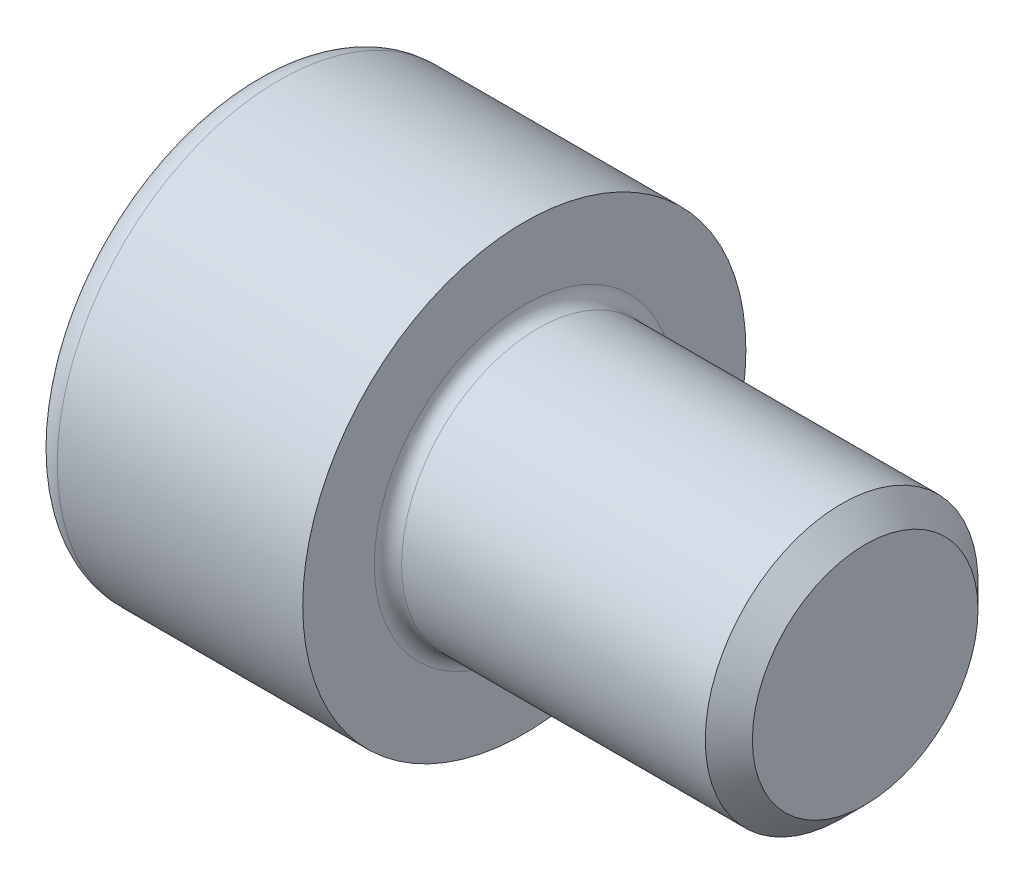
ISO-10303-21;
HEADER;
FILE_DESCRIPTION(('STEP AP214'),'2;1');
FILE_NAME('part.step','',(''),(''),'','','');
FILE_SCHEMA(('AUTOMOTIVE_DESIGN { 1 0 10303 214 1 1 1 1 }'));
ENDSEC;
DATA;
#1=APPLICATION_CONTEXT('core data for automotive mechanical design processes');
#2=APPLICATION_PROTOCOL_DEFINITION('international standard','automotive_design',2000,#1);
#3=PRODUCT_CONTEXT('',#1,'mechanical');
#4=PRODUCT('Part','Part','',(#3));
#5=PRODUCT_RELATED_PRODUCT_CATEGORY('part','',(#4));
#6=PRODUCT_DEFINITION_FORMATION('','',#4);
#7=PRODUCT_DEFINITION_CONTEXT('part definition',#1,'design');
#8=PRODUCT_DEFINITION('design','',#6,#7);
#9=PRODUCT_DEFINITION_SHAPE('','',#8);
#10=(LENGTH_UNIT() NAMED_UNIT(*) SI_UNIT(.MILLI.,.METRE.));
#11=(NAMED_UNIT(*) PLANE_ANGLE_UNIT() SI_UNIT($,.RADIAN.));
#12=(NAMED_UNIT(*) SI_UNIT($,.STERADIAN.) SOLID_ANGLE_UNIT());
#13=UNCERTAINTY_MEASURE_WITH_UNIT(LENGTH_MEASURE(1.E-05),#10,'distance_accuracy_value','');
#14=(GEOMETRIC_REPRESENTATION_CONTEXT(3) GLOBAL_UNCERTAINTY_ASSIGNED_CONTEXT((#13)) GLOBAL_UNIT_ASSIGNED_CONTEXT((#10,
#11,#12)) REPRESENTATION_CONTEXT('',''));
#15=CARTESIAN_POINT('',(0.,0.,0.));
#16=DIRECTION('',(0.,0.,1.));
#17=DIRECTION('',(1.,0.,0.));
#18=AXIS2_PLACEMENT_3D('',#15,#16,#17);
#19=CARTESIAN_POINT('',(0.,0.,0.));
#20=DIRECTION('',(-1.,0.,0.));
#21=DIRECTION('',(0.,0.,1.));
#22=AXIS2_PLACEMENT_3D('',#19,#20,#21);
#23=PLANE('',#22);
#24=DIRECTION('',(0.,-0.499999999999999,0.866025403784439));
#25=VECTOR('',#24,1.);
#26=CARTESIAN_POINT('',(0.,3.47564862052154,0.));
#27=LINE('',#26,#25);
#28=CARTESIAN_POINT('',(0.,3.47564862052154,0.));
#29=VERTEX_POINT('',#28);
#30=CARTESIAN_POINT('',(0.,1.73782431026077,3.00999999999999));
#31=VERTEX_POINT('',#30);
#32=EDGE_CURVE('E286',#29,#31,#27,.T.);
#33=ORIENTED_EDGE('',*,*,#32,.T.);
#34=DIRECTION('',(0.,1.,0.));
#35=VECTOR('',#34,1.);
#36=CARTESIAN_POINT('',(0.,-1.73782431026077,3.01));
#37=LINE('',#36,#35);
#38=CARTESIAN_POINT('',(0.,-1.73782431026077,3.01));
#39=VERTEX_POINT('',#38);
#40=EDGE_CURVE('E143',#39,#31,#37,.T.);
#41=ORIENTED_EDGE('',*,*,#40,.F.);
#42=DIRECTION('',(0.,-0.500000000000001,-0.866025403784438));
#43=VECTOR('',#42,1.);
#44=CARTESIAN_POINT('',(0.,-1.73782431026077,3.01));
#45=LINE('',#44,#43);
#46=CARTESIAN_POINT('',(0.,-3.47564862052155,0.));
#47=VERTEX_POINT('',#46);
#48=EDGE_CURVE('E291',#39,#47,#45,.T.);
#49=ORIENTED_EDGE('',*,*,#48,.T.);
#50=DIRECTION('',(0.,0.499999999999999,-0.866025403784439));
#51=VECTOR('',#50,1.);
#52=CARTESIAN_POINT('',(0.,-3.47564862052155,0.));
#53=LINE('',#52,#51);
#54=CARTESIAN_POINT('',(0.,-1.73782431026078,-3.01));
#55=VERTEX_POINT('',#54);
#56=EDGE_CURVE('E295',#47,#55,#53,.T.);
#57=ORIENTED_EDGE('',*,*,#56,.T.);
#58=DIRECTION('',(0.,-1.,0.));
#59=VECTOR('',#58,1.);
#60=CARTESIAN_POINT('',(0.,1.73782431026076,-3.01));
#61=LINE('',#60,#59);
#62=CARTESIAN_POINT('',(0.,1.73782431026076,-3.01));
#63=VERTEX_POINT('',#62);
#64=EDGE_CURVE('E299',#63,#55,#61,.T.);
#65=ORIENTED_EDGE('',*,*,#64,.F.);
#66=DIRECTION('',(0.,-0.500000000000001,-0.866025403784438));
#67=VECTOR('',#66,1.);
#68=CARTESIAN_POINT('',(0.,3.47564862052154,0.));
#69=LINE('',#68,#67);
#70=EDGE_CURVE('E138',#29,#63,#69,.T.);
#71=ORIENTED_EDGE('',*,*,#70,.F.);
#72=EDGE_LOOP('',(#33,#41,#49,#57,#65,#71));
#73=FACE_BOUND('',#72,.T.);
#74=CARTESIAN_POINT('',(0.,0.,0.));
#75=DIRECTION('',(-1.,0.,0.));
#76=DIRECTION('',(0.,0.,1.));
#77=AXIS2_PLACEMENT_3D('',#74,#75,#76);
#78=CIRCLE('',#77,5.7);
#79=CARTESIAN_POINT('',(0.,0.,5.7));
#80=VERTEX_POINT('',#79);
#81=EDGE_CURVE('E53',#80,#80,#78,.T.);
#82=ORIENTED_EDGE('',*,*,#81,.T.);
#83=EDGE_LOOP('',(#82));
#84=FACE_BOUND('',#83,.T.);
#85=ADVANCED_FACE('F44',(#73,#84),#23,.T.);
#86=CARTESIAN_POINT('',(-31.75,0.,0.));
#87=DIRECTION('',(-1.,0.,0.));
#88=DIRECTION('',(0.,0.,1.));
#89=AXIS2_PLACEMENT_3D('',#86,#87,#88);
#90=CYLINDRICAL_SURFACE('',#89,6.5);
#91=CARTESIAN_POINT('',(0.800000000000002,0.,0.));
#92=DIRECTION('',(-1.,0.,0.));
#93=DIRECTION('',(0.,0.,1.));
#94=AXIS2_PLACEMENT_3D('',#91,#92,#93);
#95=CIRCLE('',#94,6.5);
#96=CARTESIAN_POINT('',(0.800000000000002,0.,6.5));
#97=VERTEX_POINT('',#96);
#98=EDGE_CURVE('E11',#97,#97,#95,.F.);
#99=ORIENTED_EDGE('',*,*,#98,.T.);
#100=EDGE_LOOP('',(#99));
#101=FACE_BOUND('',#100,.T.);
#102=CARTESIAN_POINT('',(8.,0.,0.));
#103=DIRECTION('',(-1.,0.,0.));
#104=DIRECTION('',(0.,0.,1.));
#105=AXIS2_PLACEMENT_3D('',#102,#103,#104);
#106=CIRCLE('',#105,6.5);
#107=CARTESIAN_POINT('',(8.,0.,6.5));
#108=VERTEX_POINT('',#107);
#109=EDGE_CURVE('E167',#108,#108,#106,.T.);
#110=ORIENTED_EDGE('',*,*,#109,.T.);
#111=EDGE_LOOP('',(#110));
#112=FACE_BOUND('',#111,.T.);
#113=ADVANCED_FACE('F195',(#101,#112),#90,.T.);
#114=CARTESIAN_POINT('',(8.,6.5,0.));
#115=DIRECTION('',(1.,0.,0.));
#116=DIRECTION('',(0.,0.,-1.));
#117=AXIS2_PLACEMENT_3D('',#114,#115,#116);
#118=PLANE('',#117);
#119=CARTESIAN_POINT('',(8.,0.,0.));
#120=DIRECTION('',(1.,0.,0.));
#121=DIRECTION('',(0.,0.,-1.));
#122=AXIS2_PLACEMENT_3D('',#119,#120,#121);
#123=CIRCLE('',#122,4.39999999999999);
#124=CARTESIAN_POINT('',(8.,0.,-4.39999999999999));
#125=VERTEX_POINT('',#124);
#126=EDGE_CURVE('E171',#125,#125,#123,.F.);
#127=ORIENTED_EDGE('',*,*,#126,.T.);
#128=EDGE_LOOP('',(#127));
#129=FACE_BOUND('',#128,.T.);
#130=ORIENTED_EDGE('',*,*,#109,.F.);
#131=EDGE_LOOP('',(#130));
#132=FACE_BOUND('',#131,.T.);
#133=ADVANCED_FACE('F201',(#129,#132),#118,.T.);
#134=CARTESIAN_POINT('',(-31.75,0.,0.));
#135=DIRECTION('',(-1.,0.,0.));
#136=DIRECTION('',(0.,0.,1.));
#137=AXIS2_PLACEMENT_3D('',#134,#135,#136);
#138=CYLINDRICAL_SURFACE('',#137,3.99999999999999);
#139=CARTESIAN_POINT('',(8.4,0.,0.));
#140=DIRECTION('',(1.,0.,0.));
#141=DIRECTION('',(0.,0.,-1.));
#142=AXIS2_PLACEMENT_3D('',#139,#140,#141);
#143=CIRCLE('',#142,3.99999999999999);
#144=CARTESIAN_POINT('',(8.4,0.,-3.99999999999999));
#145=VERTEX_POINT('',#144);
#146=EDGE_CURVE('E175',#145,#145,#143,.T.);
#147=ORIENTED_EDGE('',*,*,#146,.T.);
#148=EDGE_LOOP('',(#147));
#149=FACE_BOUND('',#148,.T.);
#150=CARTESIAN_POINT('',(17.3095,0.,0.));
#151=DIRECTION('',(-1.,0.,0.));
#152=DIRECTION('',(0.,0.,1.));
#153=AXIS2_PLACEMENT_3D('',#150,#151,#152);
#154=CIRCLE('',#153,3.99999999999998);
#155=CARTESIAN_POINT('',(17.3095,0.,3.99999999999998));
#156=VERTEX_POINT('',#155);
#157=EDGE_CURVE('E163',#156,#156,#154,.T.);
#158=ORIENTED_EDGE('',*,*,#157,.T.);
#159=EDGE_LOOP('',(#158));
#160=FACE_BOUND('',#159,.T.);
#161=ADVANCED_FACE('F207',(#149,#160),#138,.T.);
#162=CARTESIAN_POINT('',(18.,0.,0.));
#163=DIRECTION('',(-1.,0.,0.));
#164=DIRECTION('',(0.,0.,1.));
#165=AXIS2_PLACEMENT_3D('',#162,#163,#164);
#166=CONICAL_SURFACE('',#165,3.3095,0.78539816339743);
#167=ORIENTED_EDGE('',*,*,#157,.F.);
#168=EDGE_LOOP('',(#167));
#169=FACE_BOUND('',#168,.T.);
#170=CARTESIAN_POINT('',(18.,0.,0.));
#171=DIRECTION('',(-1.,0.,0.));
#172=DIRECTION('',(0.,0.,1.));
#173=AXIS2_PLACEMENT_3D('',#170,#171,#172);
#174=CIRCLE('',#173,3.3095);
#175=CARTESIAN_POINT('',(18.,0.,3.3095));
#176=VERTEX_POINT('',#175);
#177=EDGE_CURVE('E158',#176,#176,#174,.T.);
#178=ORIENTED_EDGE('',*,*,#177,.T.);
#179=EDGE_LOOP('',(#178));
#180=FACE_BOUND('',#179,.T.);
#181=ADVANCED_FACE('F211',(#169,#180),#166,.T.);
#182=CARTESIAN_POINT('',(18.,3.3095,0.));
#183=DIRECTION('',(1.,0.,0.));
#184=DIRECTION('',(0.,0.,-1.));
#185=AXIS2_PLACEMENT_3D('',#182,#183,#184);
#186=PLANE('',#185);
#187=ORIENTED_EDGE('',*,*,#177,.F.);
#188=EDGE_LOOP('',(#187));
#189=FACE_BOUND('',#188,.T.);
#190=ADVANCED_FACE('F191',(#189),#186,.T.);
#191=CARTESIAN_POINT('',(8.4,0.,0.));
#192=DIRECTION('',(1.,0.,0.));
#193=DIRECTION('',(0.,0.,-1.));
#194=AXIS2_PLACEMENT_3D('',#191,#192,#193);
#195=TOROIDAL_SURFACE('',#194,4.39999999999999,0.4);
#196=ORIENTED_EDGE('',*,*,#146,.F.);
#197=EDGE_LOOP('',(#196));
#198=FACE_BOUND('',#197,.T.);
#199=ORIENTED_EDGE('',*,*,#126,.F.);
#200=EDGE_LOOP('',(#199));
#201=FACE_BOUND('',#200,.T.);
#202=ADVANCED_FACE('F184',(#198,#201),#195,.F.);
#203=CARTESIAN_POINT('',(0.800000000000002,0.,0.));
#204=DIRECTION('',(-1.,0.,0.));
#205=DIRECTION('',(0.,0.,1.));
#206=AXIS2_PLACEMENT_3D('',#203,#204,#205);
#207=TOROIDAL_SURFACE('',#206,5.7,0.8);
#208=ORIENTED_EDGE('',*,*,#98,.F.);
#209=EDGE_LOOP('',(#208));
#210=FACE_BOUND('',#209,.T.);
#211=ORIENTED_EDGE('',*,*,#81,.F.);
#212=EDGE_LOOP('',(#211));
#213=FACE_BOUND('',#212,.T.);
#214=ADVANCED_FACE('F46',(#210,#213),#207,.T.);
#215=CARTESIAN_POINT('',(4.,3.47564862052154,0.));
#216=DIRECTION('',(0.,-0.866025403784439,-0.499999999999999));
#217=DIRECTION('',(0.,0.499999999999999,-0.866025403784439));
#218=AXIS2_PLACEMENT_3D('',#215,#216,#217);
#219=PLANE('',#218);
#220=ORIENTED_EDGE('',*,*,#32,.F.);
#221=DIRECTION('',(-1.,0.,0.));
#222=VECTOR('',#221,1.);
#223=CARTESIAN_POINT('',(4.,3.47564862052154,0.));
#224=LINE('',#223,#222);
#225=CARTESIAN_POINT('',(4.,3.47564862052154,0.));
#226=VERTEX_POINT('',#225);
#227=EDGE_CURVE('E273',#226,#29,#224,.T.);
#228=ORIENTED_EDGE('',*,*,#227,.F.);
#229=DIRECTION('',(0.,-0.499999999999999,0.866025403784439));
#230=VECTOR('',#229,1.);
#231=CARTESIAN_POINT('',(4.,3.47564862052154,0.));
#232=LINE('',#231,#230);
#233=CARTESIAN_POINT('',(4.,2.60673646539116,1.50499999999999));
#234=VERTEX_POINT('',#233);
#235=EDGE_CURVE('E129',#226,#234,#232,.T.);
#236=ORIENTED_EDGE('',*,*,#235,.T.);
#237=CARTESIAN_POINT('',(4.,1.73782431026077,3.00999999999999));
#238=VERTEX_POINT('',#237);
#239=EDGE_CURVE('E119',#234,#238,#232,.T.);
#240=ORIENTED_EDGE('',*,*,#239,.T.);
#241=DIRECTION('',(-1.,0.,0.));
#242=VECTOR('',#241,1.);
#243=CARTESIAN_POINT('',(4.,1.73782431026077,3.00999999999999));
#244=LINE('',#243,#242);
#245=EDGE_CURVE('E134',#238,#31,#244,.T.);
#246=ORIENTED_EDGE('',*,*,#245,.T.);
#247=EDGE_LOOP('',(#220,#228,#236,#240,#246));
#248=FACE_BOUND('',#247,.T.);
#249=ADVANCED_FACE('F133',(#248),#219,.T.);
#250=CARTESIAN_POINT('',(4.,-1.73782431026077,3.01));
#251=DIRECTION('',(0.,0.,1.));
#252=DIRECTION('',(0.,-1.,0.));
#253=AXIS2_PLACEMENT_3D('',#250,#251,#252);
#254=PLANE('',#253);
#255=ORIENTED_EDGE('',*,*,#40,.T.);
#256=ORIENTED_EDGE('',*,*,#245,.F.);
#257=DIRECTION('',(0.,1.,0.));
#258=VECTOR('',#257,1.);
#259=CARTESIAN_POINT('',(4.,-1.73782431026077,3.01));
#260=LINE('',#259,#258);
#261=CARTESIAN_POINT('',(4.,0.,3.01));
#262=VERTEX_POINT('',#261);
#263=EDGE_CURVE('E116',#262,#238,#260,.T.);
#264=ORIENTED_EDGE('',*,*,#263,.F.);
#265=CARTESIAN_POINT('',(4.,-1.73782431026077,3.01));
#266=VERTEX_POINT('',#265);
#267=EDGE_CURVE('E128',#266,#262,#260,.T.);
#268=ORIENTED_EDGE('',*,*,#267,.F.);
#269=DIRECTION('',(-1.,0.,0.));
#270=VECTOR('',#269,1.);
#271=CARTESIAN_POINT('',(4.,-1.73782431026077,3.01));
#272=LINE('',#271,#270);
#273=EDGE_CURVE('E146',#266,#39,#272,.T.);
#274=ORIENTED_EDGE('',*,*,#273,.T.);
#275=EDGE_LOOP('',(#255,#256,#264,#268,#274));
#276=FACE_BOUND('',#275,.T.);
#277=ADVANCED_FACE('F140',(#276),#254,.F.);
#278=CARTESIAN_POINT('',(4.,-1.73782431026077,3.01));
#279=DIRECTION('',(0.,0.866025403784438,-0.500000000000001));
#280=DIRECTION('',(0.,0.500000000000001,0.866025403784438));
#281=AXIS2_PLACEMENT_3D('',#278,#279,#280);
#282=PLANE('',#281);
#283=ORIENTED_EDGE('',*,*,#48,.F.);
#284=ORIENTED_EDGE('',*,*,#273,.F.);
#285=DIRECTION('',(0.,-0.500000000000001,-0.866025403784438));
#286=VECTOR('',#285,1.);
#287=CARTESIAN_POINT('',(4.,-1.73782431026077,3.01));
#288=LINE('',#287,#286);
#289=CARTESIAN_POINT('',(4.,-2.60673646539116,1.505));
#290=VERTEX_POINT('',#289);
#291=EDGE_CURVE('E329',#266,#290,#288,.T.);
#292=ORIENTED_EDGE('',*,*,#291,.T.);
#293=CARTESIAN_POINT('',(4.,-3.47564862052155,0.));
#294=VERTEX_POINT('',#293);
#295=EDGE_CURVE('E313',#290,#294,#288,.T.);
#296=ORIENTED_EDGE('',*,*,#295,.T.);
#297=DIRECTION('',(-1.,0.,0.));
#298=VECTOR('',#297,1.);
#299=CARTESIAN_POINT('',(4.,-3.47564862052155,0.));
#300=LINE('',#299,#298);
#301=EDGE_CURVE('E153',#294,#47,#300,.T.);
#302=ORIENTED_EDGE('',*,*,#301,.T.);
#303=EDGE_LOOP('',(#283,#284,#292,#296,#302));
#304=FACE_BOUND('',#303,.T.);
#305=ADVANCED_FACE('F225',(#304),#282,.T.);
#306=CARTESIAN_POINT('',(4.,-3.47564862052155,0.));
#307=DIRECTION('',(0.,0.866025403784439,0.499999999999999));
#308=DIRECTION('',(0.,-0.499999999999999,0.866025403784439));
#309=AXIS2_PLACEMENT_3D('',#306,#307,#308);
#310=PLANE('',#309);
#311=ORIENTED_EDGE('',*,*,#56,.F.);
#312=ORIENTED_EDGE('',*,*,#301,.F.);
#313=DIRECTION('',(0.,0.499999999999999,-0.866025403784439));
#314=VECTOR('',#313,1.);
#315=CARTESIAN_POINT('',(4.,-3.47564862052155,0.));
#316=LINE('',#315,#314);
#317=CARTESIAN_POINT('',(4.,-2.60673646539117,-1.505));
#318=VERTEX_POINT('',#317);
#319=EDGE_CURVE('E281',#294,#318,#316,.T.);
#320=ORIENTED_EDGE('',*,*,#319,.T.);
#321=CARTESIAN_POINT('',(4.,-1.73782431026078,-3.01));
#322=VERTEX_POINT('',#321);
#323=EDGE_CURVE('E327',#318,#322,#316,.T.);
#324=ORIENTED_EDGE('',*,*,#323,.T.);
#325=DIRECTION('',(-1.,0.,0.));
#326=VECTOR('',#325,1.);
#327=CARTESIAN_POINT('',(4.,-1.73782431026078,-3.01));
#328=LINE('',#327,#326);
#329=EDGE_CURVE('E272',#322,#55,#328,.T.);
#330=ORIENTED_EDGE('',*,*,#329,.T.);
#331=EDGE_LOOP('',(#311,#312,#320,#324,#330));
#332=FACE_BOUND('',#331,.T.);
#333=ADVANCED_FACE('F228',(#332),#310,.T.);
#334=CARTESIAN_POINT('',(4.,1.73782431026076,-3.01));
#335=DIRECTION('',(0.,0.,-1.));
#336=DIRECTION('',(0.,1.,0.));
#337=AXIS2_PLACEMENT_3D('',#334,#335,#336);
#338=PLANE('',#337);
#339=ORIENTED_EDGE('',*,*,#64,.T.);
#340=ORIENTED_EDGE('',*,*,#329,.F.);
#341=DIRECTION('',(0.,-1.,0.));
#342=VECTOR('',#341,1.);
#343=CARTESIAN_POINT('',(4.,1.73782431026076,-3.01));
#344=LINE('',#343,#342);
#345=CARTESIAN_POINT('',(4.,0.,-3.01));
#346=VERTEX_POINT('',#345);
#347=EDGE_CURVE('E276',#346,#322,#344,.T.);
#348=ORIENTED_EDGE('',*,*,#347,.F.);
#349=CARTESIAN_POINT('',(4.,1.73782431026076,-3.01));
#350=VERTEX_POINT('',#349);
#351=EDGE_CURVE('E60',#350,#346,#344,.T.);
#352=ORIENTED_EDGE('',*,*,#351,.F.);
#353=DIRECTION('',(-1.,0.,0.));
#354=VECTOR('',#353,1.);
#355=CARTESIAN_POINT('',(4.,1.73782431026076,-3.01));
#356=LINE('',#355,#354);
#357=EDGE_CURVE('E268',#350,#63,#356,.T.);
#358=ORIENTED_EDGE('',*,*,#357,.T.);
#359=EDGE_LOOP('',(#339,#340,#348,#352,#358));
#360=FACE_BOUND('',#359,.T.);
#361=ADVANCED_FACE('F232',(#360),#338,.F.);
#362=CARTESIAN_POINT('',(4.,3.47564862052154,0.));
#363=DIRECTION('',(0.,0.866025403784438,-0.500000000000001));
#364=DIRECTION('',(0.,0.500000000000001,0.866025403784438));
#365=AXIS2_PLACEMENT_3D('',#362,#363,#364);
#366=PLANE('',#365);
#367=ORIENTED_EDGE('',*,*,#70,.T.);
#368=ORIENTED_EDGE('',*,*,#357,.F.);
#369=DIRECTION('',(0.,-0.500000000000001,-0.866025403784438));
#370=VECTOR('',#369,1.);
#371=CARTESIAN_POINT('',(4.,3.47564862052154,0.));
#372=LINE('',#371,#370);
#373=CARTESIAN_POINT('',(4.,2.60673646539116,-1.505));
#374=VERTEX_POINT('',#373);
#375=EDGE_CURVE('E257',#374,#350,#372,.T.);
#376=ORIENTED_EDGE('',*,*,#375,.F.);
#377=EDGE_CURVE('E264',#226,#374,#372,.T.);
#378=ORIENTED_EDGE('',*,*,#377,.F.);
#379=ORIENTED_EDGE('',*,*,#227,.T.);
#380=EDGE_LOOP('',(#367,#368,#376,#378,#379));
#381=FACE_BOUND('',#380,.T.);
#382=ADVANCED_FACE('F236',(#381),#366,.F.);
#383=CARTESIAN_POINT('',(4.,5.21347293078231,-3.01000000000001));
#384=DIRECTION('',(1.,0.,0.));
#385=DIRECTION('',(0.,0.,-1.));
#386=AXIS2_PLACEMENT_3D('',#383,#384,#385);
#387=PLANE('',#386);
#388=ORIENTED_EDGE('',*,*,#347,.T.);
#389=ORIENTED_EDGE('',*,*,#323,.F.);
#390=CARTESIAN_POINT('',(4.,0.,0.));
#391=DIRECTION('',(-1.,0.,0.));
#392=DIRECTION('',(0.,0.,1.));
#393=AXIS2_PLACEMENT_3D('',#390,#391,#392);
#394=CIRCLE('',#393,3.01);
#395=EDGE_CURVE('E321',#346,#318,#394,.T.);
#396=ORIENTED_EDGE('',*,*,#395,.F.);
#397=EDGE_LOOP('',(#388,#389,#396));
#398=FACE_BOUND('',#397,.T.);
#399=ADVANCED_FACE('F240',(#398),#387,.F.);
#400=ORIENTED_EDGE('',*,*,#319,.F.);
#401=ORIENTED_EDGE('',*,*,#295,.F.);
#402=EDGE_CURVE('E151',#318,#290,#394,.T.);
#403=ORIENTED_EDGE('',*,*,#402,.F.);
#404=EDGE_LOOP('',(#400,#401,#403));
#405=FACE_BOUND('',#404,.T.);
#406=ADVANCED_FACE('F243',(#405),#387,.F.);
#407=ORIENTED_EDGE('',*,*,#291,.F.);
#408=ORIENTED_EDGE('',*,*,#267,.T.);
#409=EDGE_CURVE('E145',#290,#262,#394,.T.);
#410=ORIENTED_EDGE('',*,*,#409,.F.);
#411=EDGE_LOOP('',(#407,#408,#410));
#412=FACE_BOUND('',#411,.T.);
#413=ADVANCED_FACE('F248',(#412),#387,.F.);
#414=ORIENTED_EDGE('',*,*,#263,.T.);
#415=ORIENTED_EDGE('',*,*,#239,.F.);
#416=EDGE_CURVE('E122',#262,#234,#394,.T.);
#417=ORIENTED_EDGE('',*,*,#416,.F.);
#418=EDGE_LOOP('',(#414,#415,#417));
#419=FACE_BOUND('',#418,.T.);
#420=ADVANCED_FACE('F118',(#419),#387,.F.);
#421=ORIENTED_EDGE('',*,*,#235,.F.);
#422=ORIENTED_EDGE('',*,*,#377,.T.);
#423=EDGE_CURVE('E159',#234,#374,#394,.T.);
#424=ORIENTED_EDGE('',*,*,#423,.F.);
#425=EDGE_LOOP('',(#421,#422,#424));
#426=FACE_BOUND('',#425,.T.);
#427=ADVANCED_FACE('F251',(#426),#387,.F.);
#428=ORIENTED_EDGE('',*,*,#375,.T.);
#429=ORIENTED_EDGE('',*,*,#351,.T.);
#430=EDGE_CURVE('E260',#374,#346,#394,.T.);
#431=ORIENTED_EDGE('',*,*,#430,.F.);
#432=EDGE_LOOP('',(#428,#429,#431));
#433=FACE_BOUND('',#432,.T.);
#434=ADVANCED_FACE('F221',(#433),#387,.F.);
#435=CARTESIAN_POINT('',(4.,0.,0.));
#436=DIRECTION('',(-1.,0.,0.));
#437=DIRECTION('',(0.,0.,1.));
#438=AXIS2_PLACEMENT_3D('',#435,#436,#437);
#439=CONICAL_SURFACE('',#438,3.01,1.04719755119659);
#440=CARTESIAN_POINT('',(5.73782431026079,0.,0.));
#441=VERTEX_POINT('',#440);
#442=VERTEX_LOOP('',#441);
#443=FACE_BOUND('',#442,.T.);
#444=ORIENTED_EDGE('',*,*,#416,.T.);
#445=ORIENTED_EDGE('',*,*,#423,.T.);
#446=ORIENTED_EDGE('',*,*,#430,.T.);
#447=ORIENTED_EDGE('',*,*,#395,.T.);
#448=ORIENTED_EDGE('',*,*,#402,.T.);
#449=ORIENTED_EDGE('',*,*,#409,.T.);
#450=EDGE_LOOP('',(#444,#445,#446,#447,#448,#449));
#451=FACE_BOUND('',#450,.T.);
#452=ADVANCED_FACE('F219',(#443,#451),#439,.F.);
#453=CLOSED_SHELL('',(#85,#113,#133,#161,#181,#190,#202,#214,#249,#277,#305,#333,#361,#382,#399,
#406,#413,#420,#427,#434,#452));
#454=MANIFOLD_SOLID_BREP('B2',#453);
#455=ADVANCED_BREP_SHAPE_REPRESENTATION('',(#18,#454),#14);
#456=SHAPE_DEFINITION_REPRESENTATION(#9,#455);
ENDSEC;
END-ISO-10303-21;
